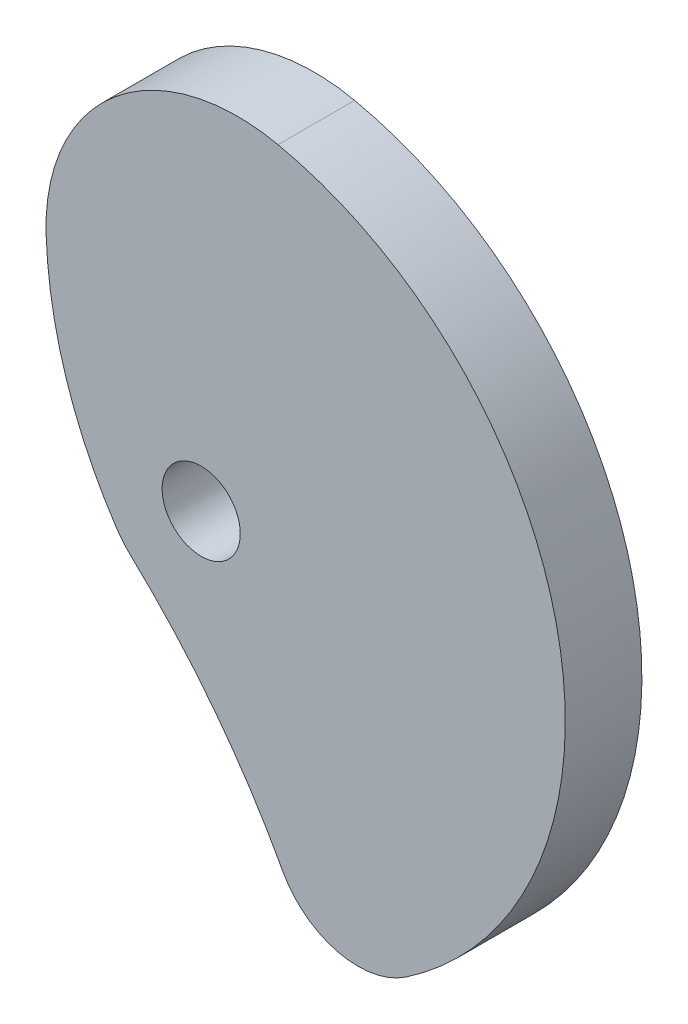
ISO-10303-21;
HEADER;
FILE_DESCRIPTION(('STEP AP214'),'2;1');
FILE_NAME('part.step','',(''),(''),'','','');
FILE_SCHEMA(('AUTOMOTIVE_DESIGN { 1 0 10303 214 1 1 1 1 }'));
ENDSEC;
DATA;
#1=APPLICATION_CONTEXT('core data for automotive mechanical design processes');
#2=APPLICATION_PROTOCOL_DEFINITION('international standard','automotive_design',2000,#1);
#3=PRODUCT_CONTEXT('',#1,'mechanical');
#4=PRODUCT('Part','Part','',(#3));
#5=PRODUCT_RELATED_PRODUCT_CATEGORY('part','',(#4));
#6=PRODUCT_DEFINITION_FORMATION('','',#4);
#7=PRODUCT_DEFINITION_CONTEXT('part definition',#1,'design');
#8=PRODUCT_DEFINITION('design','',#6,#7);
#9=PRODUCT_DEFINITION_SHAPE('','',#8);
#10=(LENGTH_UNIT() NAMED_UNIT(*) SI_UNIT(.MILLI.,.METRE.));
#11=(NAMED_UNIT(*) PLANE_ANGLE_UNIT() SI_UNIT($,.RADIAN.));
#12=(NAMED_UNIT(*) SI_UNIT($,.STERADIAN.) SOLID_ANGLE_UNIT());
#13=UNCERTAINTY_MEASURE_WITH_UNIT(LENGTH_MEASURE(1.E-05),#10,'distance_accuracy_value','');
#14=(GEOMETRIC_REPRESENTATION_CONTEXT(3) GLOBAL_UNCERTAINTY_ASSIGNED_CONTEXT((#13)) GLOBAL_UNIT_ASSIGNED_CONTEXT((#10,
#11,#12)) REPRESENTATION_CONTEXT('',''));
#15=CARTESIAN_POINT('',(0.,0.,0.));
#16=DIRECTION('',(0.,0.,1.));
#17=DIRECTION('',(1.,0.,0.));
#18=AXIS2_PLACEMENT_3D('',#15,#16,#17);
#19=CARTESIAN_POINT('',(39.45,45.06,20.));
#20=DIRECTION('',(0.,0.,1.));
#21=DIRECTION('',(1.,0.,0.));
#22=AXIS2_PLACEMENT_3D('',#19,#20,#21);
#23=PLANE('',#22);
#24=CARTESIAN_POINT('',(9.49999999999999,44.01,20.));
#25=DIRECTION('',(0.,0.,1.));
#26=DIRECTION('',(1.,0.,0.));
#27=AXIS2_PLACEMENT_3D('',#24,#25,#26);
#28=CIRCLE('',#27,49.996338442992);
#29=CARTESIAN_POINT('',(20.0492356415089,92.8807221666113,20.));
#30=VERTEX_POINT('',#29);
#31=CARTESIAN_POINT('',(-40.4656416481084,42.2582830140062,20.));
#32=VERTEX_POINT('',#31);
#33=EDGE_CURVE('E434',#30,#32,#28,.T.);
#34=ORIENTED_EDGE('',*,*,#33,.T.);
#35=CARTESIAN_POINT('',(69.4,46.11,20.));
#36=DIRECTION('',(0.,0.,1.));
#37=DIRECTION('',(1.,0.,0.));
#38=AXIS2_PLACEMENT_3D('',#35,#36,#37);
#39=CIRCLE('',#38,109.933138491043);
#40=CARTESIAN_POINT('',(-22.1651898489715,-14.7267565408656,20.));
#41=VERTEX_POINT('',#40);
#42=EDGE_CURVE('E415',#32,#41,#39,.T.);
#43=ORIENTED_EDGE('',*,*,#42,.T.);
#44=CARTESIAN_POINT('',(0.,0.,20.));
#45=DIRECTION('',(0.,0.,1.));
#46=DIRECTION('',(1.,0.,0.));
#47=AXIS2_PLACEMENT_3D('',#44,#45,#46);
#48=CIRCLE('',#47,26.6115200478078);
#49=CARTESIAN_POINT('',(-18.1937637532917,-19.4206065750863,20.));
#50=VERTEX_POINT('',#49);
#51=EDGE_CURVE('E437',#41,#50,#48,.T.);
#52=ORIENTED_EDGE('',*,*,#51,.T.);
#53=CARTESIAN_POINT('',(-155.31945929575,-165.792969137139,20.));
#54=DIRECTION('',(0.,0.,-1.));
#55=DIRECTION('',(1.,0.,0.));
#56=AXIS2_PLACEMENT_3D('',#53,#54,#55);
#57=CIRCLE('',#56,200.57);
#58=CARTESIAN_POINT('',(21.2427491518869,-70.6398743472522,20.));
#59=VERTEX_POINT('',#58);
#60=EDGE_CURVE('E439',#50,#59,#57,.T.);
#61=ORIENTED_EDGE('',*,*,#60,.T.);
#62=CARTESIAN_POINT('',(40.93,-60.03,20.));
#63=DIRECTION('',(0.,0.,1.));
#64=DIRECTION('',(1.,0.,0.));
#65=AXIS2_PLACEMENT_3D('',#62,#63,#64);
#66=CIRCLE('',#65,22.3641963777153);
#67=CARTESIAN_POINT('',(53.5286708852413,-78.507845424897,20.));
#68=VERTEX_POINT('',#67);
#69=EDGE_CURVE('E368',#59,#68,#66,.T.);
#70=ORIENTED_EDGE('',*,*,#69,.T.);
#71=CARTESIAN_POINT('',(0.,0.,20.));
#72=DIRECTION('',(0.,0.,1.));
#73=DIRECTION('',(1.,0.,0.));
#74=AXIS2_PLACEMENT_3D('',#71,#72,#73);
#75=CIRCLE('',#74,95.02);
#76=EDGE_CURVE('E363',#68,#30,#75,.T.);
#77=ORIENTED_EDGE('',*,*,#76,.T.);
#78=EDGE_LOOP('',(#34,#43,#52,#61,#70,#77));
#79=FACE_BOUND('',#78,.T.);
#80=CARTESIAN_POINT('',(0.,0.,20.));
#81=DIRECTION('',(0.,0.,1.));
#82=DIRECTION('',(1.,0.,0.));
#83=AXIS2_PLACEMENT_3D('',#80,#81,#82);
#84=CIRCLE('',#83,10.1973058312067);
#85=CARTESIAN_POINT('',(10.1973058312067,0.,20.));
#86=VERTEX_POINT('',#85);
#87=EDGE_CURVE('E420',#86,#86,#84,.T.);
#88=ORIENTED_EDGE('',*,*,#87,.F.);
#89=EDGE_LOOP('',(#88));
#90=FACE_BOUND('',#89,.T.);
#91=ADVANCED_FACE('F348',(#79,#90),#23,.T.);
#92=CARTESIAN_POINT('',(39.45,45.06,0.));
#93=DIRECTION('',(0.,0.,1.));
#94=DIRECTION('',(1.,0.,0.));
#95=AXIS2_PLACEMENT_3D('',#92,#93,#94);
#96=PLANE('',#95);
#97=CARTESIAN_POINT('',(9.49999999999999,44.01,0.));
#98=DIRECTION('',(0.,0.,1.));
#99=DIRECTION('',(1.,0.,0.));
#100=AXIS2_PLACEMENT_3D('',#97,#98,#99);
#101=CIRCLE('',#100,49.996338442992);
#102=CARTESIAN_POINT('',(20.0492356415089,92.8807221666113,0.));
#103=VERTEX_POINT('',#102);
#104=CARTESIAN_POINT('',(-40.4656416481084,42.2582830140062,0.));
#105=VERTEX_POINT('',#104);
#106=EDGE_CURVE('E406',#103,#105,#101,.T.);
#107=ORIENTED_EDGE('',*,*,#106,.F.);
#108=CARTESIAN_POINT('',(0.,0.,0.));
#109=DIRECTION('',(0.,0.,1.));
#110=DIRECTION('',(1.,0.,0.));
#111=AXIS2_PLACEMENT_3D('',#108,#109,#110);
#112=CIRCLE('',#111,95.02);
#113=CARTESIAN_POINT('',(53.5286708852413,-78.507845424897,0.));
#114=VERTEX_POINT('',#113);
#115=EDGE_CURVE('E432',#114,#103,#112,.T.);
#116=ORIENTED_EDGE('',*,*,#115,.F.);
#117=CARTESIAN_POINT('',(40.93,-60.03,0.));
#118=DIRECTION('',(0.,0.,1.));
#119=DIRECTION('',(1.,0.,0.));
#120=AXIS2_PLACEMENT_3D('',#117,#118,#119);
#121=CIRCLE('',#120,22.3641963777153);
#122=CARTESIAN_POINT('',(21.2427491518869,-70.6398743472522,0.));
#123=VERTEX_POINT('',#122);
#124=EDGE_CURVE('E430',#123,#114,#121,.T.);
#125=ORIENTED_EDGE('',*,*,#124,.F.);
#126=CARTESIAN_POINT('',(-155.31945929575,-165.792969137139,0.));
#127=DIRECTION('',(0.,0.,-1.));
#128=DIRECTION('',(1.,0.,0.));
#129=AXIS2_PLACEMENT_3D('',#126,#127,#128);
#130=CIRCLE('',#129,200.57);
#131=CARTESIAN_POINT('',(-18.1937637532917,-19.4206065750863,0.));
#132=VERTEX_POINT('',#131);
#133=EDGE_CURVE('E428',#132,#123,#130,.T.);
#134=ORIENTED_EDGE('',*,*,#133,.F.);
#135=CARTESIAN_POINT('',(0.,0.,0.));
#136=DIRECTION('',(0.,0.,1.));
#137=DIRECTION('',(1.,0.,0.));
#138=AXIS2_PLACEMENT_3D('',#135,#136,#137);
#139=CIRCLE('',#138,26.6115200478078);
#140=CARTESIAN_POINT('',(-22.1651898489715,-14.7267565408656,0.));
#141=VERTEX_POINT('',#140);
#142=EDGE_CURVE('E408',#141,#132,#139,.T.);
#143=ORIENTED_EDGE('',*,*,#142,.F.);
#144=CARTESIAN_POINT('',(69.4,46.11,0.));
#145=DIRECTION('',(0.,0.,1.));
#146=DIRECTION('',(1.,0.,0.));
#147=AXIS2_PLACEMENT_3D('',#144,#145,#146);
#148=CIRCLE('',#147,109.933138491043);
#149=EDGE_CURVE('E401',#105,#141,#148,.T.);
#150=ORIENTED_EDGE('',*,*,#149,.F.);
#151=EDGE_LOOP('',(#107,#116,#125,#134,#143,#150));
#152=FACE_BOUND('',#151,.T.);
#153=CARTESIAN_POINT('',(0.,0.,0.));
#154=DIRECTION('',(0.,0.,1.));
#155=DIRECTION('',(1.,0.,0.));
#156=AXIS2_PLACEMENT_3D('',#153,#154,#155);
#157=CIRCLE('',#156,10.1973058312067);
#158=CARTESIAN_POINT('',(10.1973058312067,0.,0.));
#159=VERTEX_POINT('',#158);
#160=EDGE_CURVE('E423',#159,#159,#157,.T.);
#161=ORIENTED_EDGE('',*,*,#160,.T.);
#162=EDGE_LOOP('',(#161));
#163=FACE_BOUND('',#162,.T.);
#164=ADVANCED_FACE('F402',(#152,#163),#96,.F.);
#165=CARTESIAN_POINT('',(9.49999999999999,44.01,20.));
#166=DIRECTION('',(0.,0.,-1.));
#167=DIRECTION('',(-1.,0.,0.));
#168=AXIS2_PLACEMENT_3D('',#165,#166,#167);
#169=CYLINDRICAL_SURFACE('',#168,49.996338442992);
#170=ORIENTED_EDGE('',*,*,#106,.T.);
#171=DIRECTION('',(0.,0.,-1.));
#172=VECTOR('',#171,1.);
#173=CARTESIAN_POINT('',(-40.4656416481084,42.2582830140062,20.));
#174=LINE('',#173,#172);
#175=EDGE_CURVE('E11',#32,#105,#174,.T.);
#176=ORIENTED_EDGE('',*,*,#175,.F.);
#177=ORIENTED_EDGE('',*,*,#33,.F.);
#178=DIRECTION('',(0.,0.,-1.));
#179=VECTOR('',#178,1.);
#180=CARTESIAN_POINT('',(20.0492356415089,92.8807221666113,20.));
#181=LINE('',#180,#179);
#182=EDGE_CURVE('E419',#30,#103,#181,.T.);
#183=ORIENTED_EDGE('',*,*,#182,.T.);
#184=EDGE_LOOP('',(#170,#176,#177,#183));
#185=FACE_BOUND('',#184,.T.);
#186=ADVANCED_FACE('F350',(#185),#169,.T.);
#187=CARTESIAN_POINT('',(69.4,46.11,20.));
#188=DIRECTION('',(0.,0.,-1.));
#189=DIRECTION('',(-1.,0.,0.));
#190=AXIS2_PLACEMENT_3D('',#187,#188,#189);
#191=CYLINDRICAL_SURFACE('',#190,109.933138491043);
#192=ORIENTED_EDGE('',*,*,#149,.T.);
#193=DIRECTION('',(0.,0.,-1.));
#194=VECTOR('',#193,1.);
#195=CARTESIAN_POINT('',(-22.1651898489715,-14.7267565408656,20.));
#196=LINE('',#195,#194);
#197=EDGE_CURVE('E356',#41,#141,#196,.T.);
#198=ORIENTED_EDGE('',*,*,#197,.F.);
#199=ORIENTED_EDGE('',*,*,#42,.F.);
#200=ORIENTED_EDGE('',*,*,#175,.T.);
#201=EDGE_LOOP('',(#192,#198,#199,#200));
#202=FACE_BOUND('',#201,.T.);
#203=ADVANCED_FACE('F414',(#202),#191,.T.);
#204=CARTESIAN_POINT('',(0.,0.,20.));
#205=DIRECTION('',(0.,0.,-1.));
#206=DIRECTION('',(-1.,0.,0.));
#207=AXIS2_PLACEMENT_3D('',#204,#205,#206);
#208=CYLINDRICAL_SURFACE('',#207,26.6115200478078);
#209=ORIENTED_EDGE('',*,*,#142,.T.);
#210=DIRECTION('',(0.,0.,-1.));
#211=VECTOR('',#210,1.);
#212=CARTESIAN_POINT('',(-18.1937637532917,-19.4206065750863,20.));
#213=LINE('',#212,#211);
#214=EDGE_CURVE('E450',#50,#132,#213,.T.);
#215=ORIENTED_EDGE('',*,*,#214,.F.);
#216=ORIENTED_EDGE('',*,*,#51,.F.);
#217=ORIENTED_EDGE('',*,*,#197,.T.);
#218=EDGE_LOOP('',(#209,#215,#216,#217));
#219=FACE_BOUND('',#218,.T.);
#220=ADVANCED_FACE('F454',(#219),#208,.T.);
#221=CARTESIAN_POINT('',(-155.31945929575,-165.792969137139,20.));
#222=DIRECTION('',(0.,0.,-1.));
#223=DIRECTION('',(-1.,0.,0.));
#224=AXIS2_PLACEMENT_3D('',#221,#222,#223);
#225=CYLINDRICAL_SURFACE('',#224,200.57);
#226=ORIENTED_EDGE('',*,*,#133,.T.);
#227=DIRECTION('',(0.,0.,-1.));
#228=VECTOR('',#227,1.);
#229=CARTESIAN_POINT('',(21.2427491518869,-70.6398743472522,20.));
#230=LINE('',#229,#228);
#231=EDGE_CURVE('E447',#59,#123,#230,.T.);
#232=ORIENTED_EDGE('',*,*,#231,.F.);
#233=ORIENTED_EDGE('',*,*,#60,.F.);
#234=ORIENTED_EDGE('',*,*,#214,.T.);
#235=EDGE_LOOP('',(#226,#232,#233,#234));
#236=FACE_BOUND('',#235,.T.);
#237=ADVANCED_FACE('F460',(#236),#225,.F.);
#238=CARTESIAN_POINT('',(40.93,-60.03,20.));
#239=DIRECTION('',(0.,0.,-1.));
#240=DIRECTION('',(-1.,0.,0.));
#241=AXIS2_PLACEMENT_3D('',#238,#239,#240);
#242=CYLINDRICAL_SURFACE('',#241,22.3641963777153);
#243=ORIENTED_EDGE('',*,*,#124,.T.);
#244=DIRECTION('',(0.,0.,-1.));
#245=VECTOR('',#244,1.);
#246=CARTESIAN_POINT('',(53.5286708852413,-78.507845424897,20.));
#247=LINE('',#246,#245);
#248=EDGE_CURVE('E444',#68,#114,#247,.T.);
#249=ORIENTED_EDGE('',*,*,#248,.F.);
#250=ORIENTED_EDGE('',*,*,#69,.F.);
#251=ORIENTED_EDGE('',*,*,#231,.T.);
#252=EDGE_LOOP('',(#243,#249,#250,#251));
#253=FACE_BOUND('',#252,.T.);
#254=ADVANCED_FACE('F463',(#253),#242,.T.);
#255=CARTESIAN_POINT('',(0.,0.,20.));
#256=DIRECTION('',(0.,0.,-1.));
#257=DIRECTION('',(-1.,0.,0.));
#258=AXIS2_PLACEMENT_3D('',#255,#256,#257);
#259=CYLINDRICAL_SURFACE('',#258,95.02);
#260=ORIENTED_EDGE('',*,*,#115,.T.);
#261=ORIENTED_EDGE('',*,*,#182,.F.);
#262=ORIENTED_EDGE('',*,*,#76,.F.);
#263=ORIENTED_EDGE('',*,*,#248,.T.);
#264=EDGE_LOOP('',(#260,#261,#262,#263));
#265=FACE_BOUND('',#264,.T.);
#266=ADVANCED_FACE('F465',(#265),#259,.T.);
#267=CARTESIAN_POINT('',(0.,0.,20.));
#268=DIRECTION('',(0.,0.,-1.));
#269=DIRECTION('',(-1.,0.,0.));
#270=AXIS2_PLACEMENT_3D('',#267,#268,#269);
#271=CYLINDRICAL_SURFACE('',#270,10.1973058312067);
#272=ORIENTED_EDGE('',*,*,#87,.T.);
#273=EDGE_LOOP('',(#272));
#274=FACE_BOUND('',#273,.T.);
#275=ORIENTED_EDGE('',*,*,#160,.F.);
#276=EDGE_LOOP('',(#275));
#277=FACE_BOUND('',#276,.T.);
#278=ADVANCED_FACE('F467',(#274,#277),#271,.F.);
#279=CLOSED_SHELL('',(#91,#164,#186,#203,#220,#237,#254,#266,#278));
#280=MANIFOLD_SOLID_BREP('B2',#279);
#281=ADVANCED_BREP_SHAPE_REPRESENTATION('',(#18,#280),#14);
#282=SHAPE_DEFINITION_REPRESENTATION(#9,#281);
ENDSEC;
END-ISO-10303-21;
